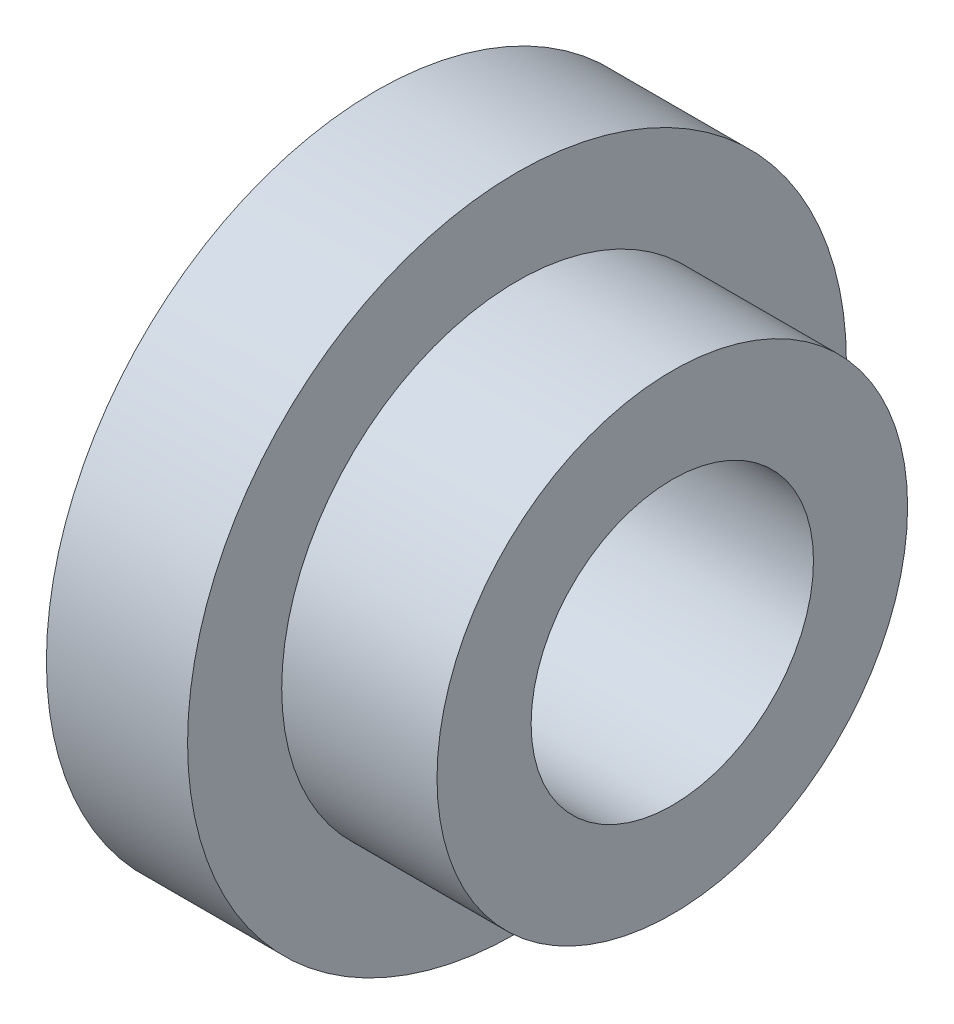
ISO-10303-21;
HEADER;
FILE_DESCRIPTION(('STEP AP214'),'2;1');
FILE_NAME('part.step','',(''),(''),'','','');
FILE_SCHEMA(('AUTOMOTIVE_DESIGN { 1 0 10303 214 1 1 1 1 }'));
ENDSEC;
DATA;
#1=APPLICATION_CONTEXT('core data for automotive mechanical design processes');
#2=APPLICATION_PROTOCOL_DEFINITION('international standard','automotive_design',2000,#1);
#3=PRODUCT_CONTEXT('',#1,'mechanical');
#4=PRODUCT('Part','Part','',(#3));
#5=PRODUCT_RELATED_PRODUCT_CATEGORY('part','',(#4));
#6=PRODUCT_DEFINITION_FORMATION('','',#4);
#7=PRODUCT_DEFINITION_CONTEXT('part definition',#1,'design');
#8=PRODUCT_DEFINITION('design','',#6,#7);
#9=PRODUCT_DEFINITION_SHAPE('','',#8);
#10=(LENGTH_UNIT() NAMED_UNIT(*) SI_UNIT(.MILLI.,.METRE.));
#11=(NAMED_UNIT(*) PLANE_ANGLE_UNIT() SI_UNIT($,.RADIAN.));
#12=(NAMED_UNIT(*) SI_UNIT($,.STERADIAN.) SOLID_ANGLE_UNIT());
#13=UNCERTAINTY_MEASURE_WITH_UNIT(LENGTH_MEASURE(1.E-05),#10,'distance_accuracy_value','');
#14=(GEOMETRIC_REPRESENTATION_CONTEXT(3) GLOBAL_UNCERTAINTY_ASSIGNED_CONTEXT((#13)) GLOBAL_UNIT_ASSIGNED_CONTEXT((#10,
#11,#12)) REPRESENTATION_CONTEXT('',''));
#15=CARTESIAN_POINT('',(0.,0.,0.));
#16=DIRECTION('',(0.,0.,1.));
#17=DIRECTION('',(1.,0.,0.));
#18=AXIS2_PLACEMENT_3D('',#15,#16,#17);
#19=CARTESIAN_POINT('',(0.,0.,-6.99999999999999));
#20=DIRECTION('',(1.,0.,0.));
#21=DIRECTION('',(0.,0.,-1.));
#22=AXIS2_PLACEMENT_3D('',#19,#20,#21);
#23=PLANE('',#22);
#24=CARTESIAN_POINT('',(0.,0.,0.));
#25=DIRECTION('',(1.,0.,0.));
#26=DIRECTION('',(0.,0.,-1.));
#27=AXIS2_PLACEMENT_3D('',#24,#25,#26);
#28=CIRCLE('',#27,3.);
#29=CARTESIAN_POINT('',(0.,0.,-3.));
#30=VERTEX_POINT('',#29);
#31=EDGE_CURVE('E47',#30,#30,#28,.T.);
#32=ORIENTED_EDGE('',*,*,#31,.T.);
#33=EDGE_LOOP('',(#32));
#34=FACE_BOUND('',#33,.T.);
#35=CARTESIAN_POINT('',(0.,0.,0.));
#36=DIRECTION('',(-1.,0.,0.));
#37=DIRECTION('',(0.,0.,1.));
#38=AXIS2_PLACEMENT_3D('',#35,#36,#37);
#39=CIRCLE('',#38,6.99999999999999);
#40=CARTESIAN_POINT('',(0.,0.,6.99999999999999));
#41=VERTEX_POINT('',#40);
#42=EDGE_CURVE('E42',#41,#41,#39,.T.);
#43=ORIENTED_EDGE('',*,*,#42,.T.);
#44=EDGE_LOOP('',(#43));
#45=FACE_BOUND('',#44,.T.);
#46=ADVANCED_FACE('F28',(#34,#45),#23,.F.);
#47=CARTESIAN_POINT('',(6.3,0.,0.));
#48=DIRECTION('',(-1.,0.,0.));
#49=DIRECTION('',(0.,0.,1.));
#50=AXIS2_PLACEMENT_3D('',#47,#48,#49);
#51=PLANE('',#50);
#52=CARTESIAN_POINT('',(6.3,0.,0.));
#53=DIRECTION('',(1.,0.,0.));
#54=DIRECTION('',(0.,0.,-1.));
#55=AXIS2_PLACEMENT_3D('',#52,#53,#54);
#56=CIRCLE('',#55,3.);
#57=CARTESIAN_POINT('',(6.3,0.,-3.));
#58=VERTEX_POINT('',#57);
#59=EDGE_CURVE('E50',#58,#58,#56,.T.);
#60=ORIENTED_EDGE('',*,*,#59,.F.);
#61=EDGE_LOOP('',(#60));
#62=FACE_BOUND('',#61,.T.);
#63=CARTESIAN_POINT('',(6.3,0.,0.));
#64=DIRECTION('',(-1.,0.,0.));
#65=DIRECTION('',(0.,0.,1.));
#66=AXIS2_PLACEMENT_3D('',#63,#64,#65);
#67=CIRCLE('',#66,5.);
#68=CARTESIAN_POINT('',(6.3,0.,5.));
#69=VERTEX_POINT('',#68);
#70=EDGE_CURVE('E10',#69,#69,#67,.T.);
#71=ORIENTED_EDGE('',*,*,#70,.F.);
#72=EDGE_LOOP('',(#71));
#73=FACE_BOUND('',#72,.T.);
#74=ADVANCED_FACE('F56',(#62,#73),#51,.F.);
#75=CARTESIAN_POINT('',(0.,0.,0.));
#76=DIRECTION('',(-1.,0.,0.));
#77=DIRECTION('',(0.,0.,1.));
#78=AXIS2_PLACEMENT_3D('',#75,#76,#77);
#79=CYLINDRICAL_SURFACE('',#78,5.);
#80=CARTESIAN_POINT('',(3.,0.,0.));
#81=DIRECTION('',(-1.,0.,0.));
#82=DIRECTION('',(0.,0.,1.));
#83=AXIS2_PLACEMENT_3D('',#80,#81,#82);
#84=CIRCLE('',#83,5.);
#85=CARTESIAN_POINT('',(3.,0.,5.));
#86=VERTEX_POINT('',#85);
#87=EDGE_CURVE('E34',#86,#86,#84,.T.);
#88=ORIENTED_EDGE('',*,*,#87,.F.);
#89=EDGE_LOOP('',(#88));
#90=FACE_BOUND('',#89,.T.);
#91=ORIENTED_EDGE('',*,*,#70,.T.);
#92=EDGE_LOOP('',(#91));
#93=FACE_BOUND('',#92,.T.);
#94=ADVANCED_FACE('F59',(#90,#93),#79,.T.);
#95=CARTESIAN_POINT('',(3.,0.,-5.));
#96=DIRECTION('',(-1.,0.,0.));
#97=DIRECTION('',(0.,0.,1.));
#98=AXIS2_PLACEMENT_3D('',#95,#96,#97);
#99=PLANE('',#98);
#100=CARTESIAN_POINT('',(3.,0.,0.));
#101=DIRECTION('',(-1.,0.,0.));
#102=DIRECTION('',(0.,0.,1.));
#103=AXIS2_PLACEMENT_3D('',#100,#101,#102);
#104=CIRCLE('',#103,7.);
#105=CARTESIAN_POINT('',(3.,0.,7.));
#106=VERTEX_POINT('',#105);
#107=EDGE_CURVE('E38',#106,#106,#104,.T.);
#108=ORIENTED_EDGE('',*,*,#107,.F.);
#109=EDGE_LOOP('',(#108));
#110=FACE_BOUND('',#109,.T.);
#111=ORIENTED_EDGE('',*,*,#87,.T.);
#112=EDGE_LOOP('',(#111));
#113=FACE_BOUND('',#112,.T.);
#114=ADVANCED_FACE('F64',(#110,#113),#99,.F.);
#115=CARTESIAN_POINT('',(0.,0.,0.));
#116=DIRECTION('',(-1.,0.,0.));
#117=DIRECTION('',(0.,0.,1.));
#118=AXIS2_PLACEMENT_3D('',#115,#116,#117);
#119=CYLINDRICAL_SURFACE('',#118,7.);
#120=ORIENTED_EDGE('',*,*,#42,.F.);
#121=EDGE_LOOP('',(#120));
#122=FACE_BOUND('',#121,.T.);
#123=ORIENTED_EDGE('',*,*,#107,.T.);
#124=EDGE_LOOP('',(#123));
#125=FACE_BOUND('',#124,.T.);
#126=ADVANCED_FACE('F71',(#122,#125),#119,.T.);
#127=CARTESIAN_POINT('',(0.,0.,0.));
#128=DIRECTION('',(1.,0.,0.));
#129=DIRECTION('',(0.,0.,-1.));
#130=AXIS2_PLACEMENT_3D('',#127,#128,#129);
#131=CYLINDRICAL_SURFACE('',#130,3.);
#132=CARTESIAN_POINT('',(0.,0.,-3.));
#133=CARTESIAN_POINT('',(0.0656250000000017,0.,-3.));
#134=CARTESIAN_POINT('',(0.131250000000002,0.,-3.));
#135=CARTESIAN_POINT('',(0.262500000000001,0.,-3.));
#136=CARTESIAN_POINT('',(0.328125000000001,0.,-3.));
#137=CARTESIAN_POINT('',(0.459375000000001,0.,-3.));
#138=CARTESIAN_POINT('',(0.525000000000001,0.,-3.));
#139=CARTESIAN_POINT('',(0.656250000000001,0.,-3.));
#140=CARTESIAN_POINT('',(0.721875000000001,0.,-3.));
#141=CARTESIAN_POINT('',(0.853125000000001,0.,-3.));
#142=CARTESIAN_POINT('',(0.918750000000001,0.,-3.));
#143=CARTESIAN_POINT('',(1.05,0.,-3.));
#144=CARTESIAN_POINT('',(1.115625,0.,-3.));
#145=CARTESIAN_POINT('',(1.246875,0.,-3.));
#146=CARTESIAN_POINT('',(1.3125,0.,-3.));
#147=CARTESIAN_POINT('',(1.44375,0.,-3.));
#148=CARTESIAN_POINT('',(1.509375,0.,-3.));
#149=CARTESIAN_POINT('',(1.640625,0.,-3.));
#150=CARTESIAN_POINT('',(1.70625,0.,-3.));
#151=CARTESIAN_POINT('',(1.8375,0.,-3.));
#152=CARTESIAN_POINT('',(1.903125,0.,-3.));
#153=CARTESIAN_POINT('',(2.034375,0.,-3.));
#154=CARTESIAN_POINT('',(2.1,0.,-3.));
#155=CARTESIAN_POINT('',(2.23125,0.,-3.));
#156=CARTESIAN_POINT('',(2.296875,0.,-3.));
#157=CARTESIAN_POINT('',(2.428125,0.,-3.));
#158=CARTESIAN_POINT('',(2.49375,0.,-3.));
#159=CARTESIAN_POINT('',(2.625,0.,-3.));
#160=CARTESIAN_POINT('',(2.690625,0.,-3.));
#161=CARTESIAN_POINT('',(2.821875,0.,-3.));
#162=CARTESIAN_POINT('',(2.8875,0.,-3.));
#163=CARTESIAN_POINT('',(3.01875,0.,-3.));
#164=CARTESIAN_POINT('',(3.084375,0.,-3.));
#165=CARTESIAN_POINT('',(3.215625,0.,-3.));
#166=CARTESIAN_POINT('',(3.28125,0.,-3.));
#167=CARTESIAN_POINT('',(3.4125,0.,-3.));
#168=CARTESIAN_POINT('',(3.478125,0.,-3.));
#169=CARTESIAN_POINT('',(3.609375,0.,-3.));
#170=CARTESIAN_POINT('',(3.675,0.,-3.));
#171=CARTESIAN_POINT('',(3.80625,0.,-3.));
#172=CARTESIAN_POINT('',(3.871875,0.,-3.));
#173=CARTESIAN_POINT('',(4.003125,0.,-3.));
#174=CARTESIAN_POINT('',(4.06875,0.,-3.));
#175=CARTESIAN_POINT('',(4.2,0.,-3.));
#176=CARTESIAN_POINT('',(4.265625,0.,-3.));
#177=CARTESIAN_POINT('',(4.396875,0.,-3.));
#178=CARTESIAN_POINT('',(4.4625,0.,-3.));
#179=CARTESIAN_POINT('',(4.59375,0.,-3.));
#180=CARTESIAN_POINT('',(4.659375,0.,-3.));
#181=CARTESIAN_POINT('',(4.790625,0.,-3.));
#182=CARTESIAN_POINT('',(4.85625,0.,-3.));
#183=CARTESIAN_POINT('',(4.9875,0.,-3.));
#184=CARTESIAN_POINT('',(5.053125,0.,-3.));
#185=CARTESIAN_POINT('',(5.184375,0.,-3.));
#186=CARTESIAN_POINT('',(5.25,0.,-3.));
#187=CARTESIAN_POINT('',(5.38125,0.,-3.));
#188=CARTESIAN_POINT('',(5.446875,0.,-3.));
#189=CARTESIAN_POINT('',(5.578125,0.,-3.));
#190=CARTESIAN_POINT('',(5.64375,0.,-3.));
#191=CARTESIAN_POINT('',(5.775,0.,-3.));
#192=CARTESIAN_POINT('',(5.840625,0.,-3.));
#193=CARTESIAN_POINT('',(5.971875,0.,-3.));
#194=CARTESIAN_POINT('',(6.0375,0.,-3.));
#195=CARTESIAN_POINT('',(6.16875,0.,-3.));
#196=CARTESIAN_POINT('',(6.234375,0.,-3.));
#197=CARTESIAN_POINT('',(6.3,0.,-3.));
#198=B_SPLINE_CURVE_WITH_KNOTS('',3,(#132,#133,#134,#135,#136,#137,#138,#139,#140,#141,#142,
#143,#144,#145,#146,#147,#148,#149,#150,#151,#152,#153,#154,#155,#156,#157,#158,#159,#160,#161,
#162,#163,#164,#165,#166,#167,#168,#169,#170,#171,#172,#173,#174,#175,#176,#177,#178,#179,#180,
#181,#182,#183,#184,#185,#186,#187,#188,#189,#190,#191,#192,#193,#194,#195,#196,#197),
.UNSPECIFIED.,.F.,.F.,(4,2,2,2,2,2,2,2,2,2,2,2,2,2,2,2,2,2,2,2,2,2,2,2,2,2,2,2,2,2,2,2,4),(0.,
0.196875,0.39375,0.590625,0.787499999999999,0.984374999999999,1.18125,1.378125,1.575,1.771875,
1.96875,2.165625,2.3625,2.559375,2.75625,2.953125,3.15,3.346875,3.54375,3.740625,3.9375,
4.134375,4.33125,4.528125,4.725,4.92187499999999,5.11875,5.31562499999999,5.51249999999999,
5.709375,5.90624999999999,6.10312499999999,6.29999999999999),.UNSPECIFIED.);
#199=EDGE_CURVE('BSEAM54',#30,#58,#198,.T.);
#200=ORIENTED_EDGE('',*,*,#31,.F.);
#201=ORIENTED_EDGE('',*,*,#59,.T.);
#202=ORIENTED_EDGE('',*,*,#199,.T.);
#203=ORIENTED_EDGE('',*,*,#199,.F.);
#204=EDGE_LOOP('',(#200,#202,#201,#203));
#205=FACE_BOUND('',#204,.T.);
#206=ADVANCED_FACE('F54',(#205),#131,.F.);
#207=CLOSED_SHELL('',(#46,#74,#94,#114,#126,#206));
#208=MANIFOLD_SOLID_BREP('B2',#207);
#209=ADVANCED_BREP_SHAPE_REPRESENTATION('',(#18,#208),#14);
#210=SHAPE_DEFINITION_REPRESENTATION(#9,#209);
ENDSEC;
END-ISO-10303-21;
